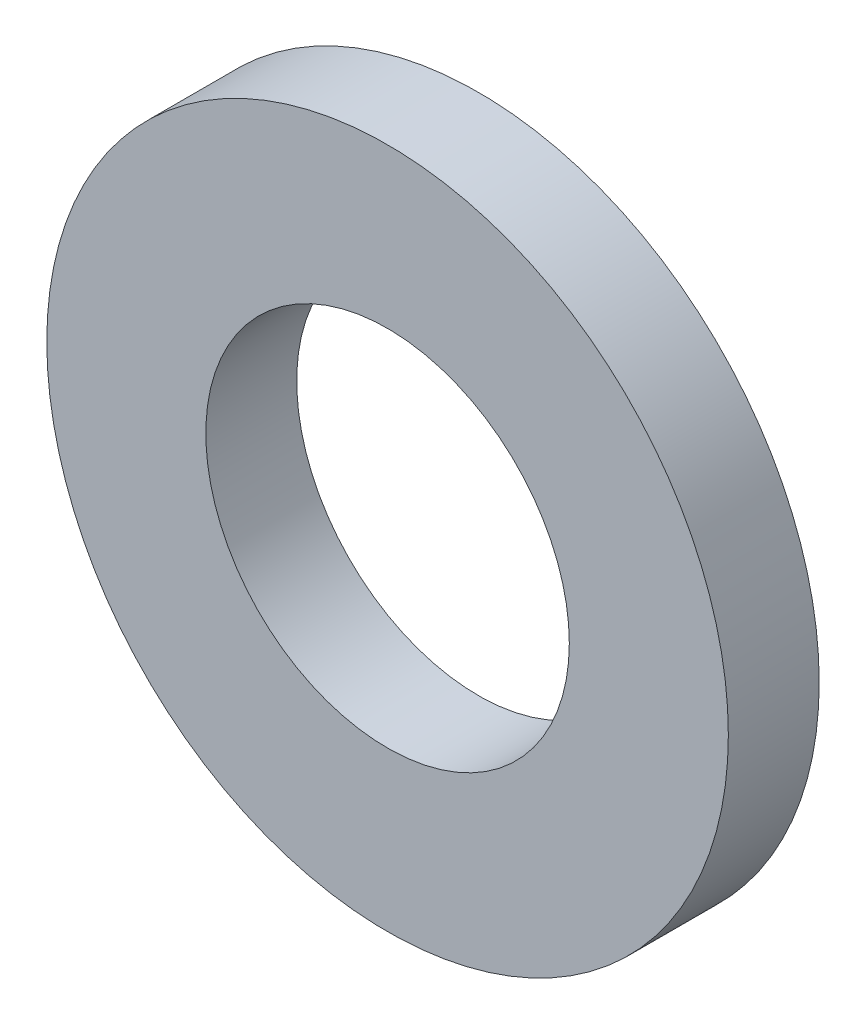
from build123d import *

# Parameters (mm, degrees)
CROQUIS1_R              = 7.5
CROQUIS1_R_2            = 4
SALIENTE_EXTRUIR1_DEPTH = 1


with BuildPart() as part:
    # Croquis1 → Saliente-Extruir1 (new, symmetric)
    with BuildSketch(Plane.XY):
        Circle(CROQUIS1_R)
        Circle(CROQUIS1_R_2, mode=Mode.SUBTRACT)
    extrude(amount=SALIENTE_EXTRUIR1_DEPTH, both=True)


solid = part.part
